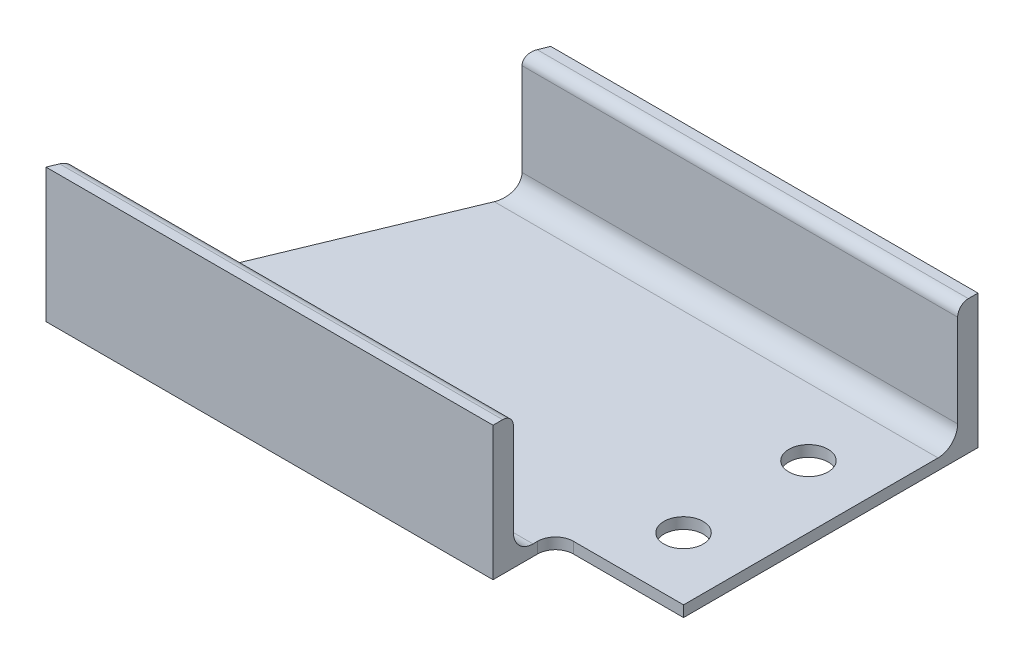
ISO-10303-21;
HEADER;
FILE_DESCRIPTION(('STEP AP214'),'2;1');
FILE_NAME('part.step','',(''),(''),'','','');
FILE_SCHEMA(('AUTOMOTIVE_DESIGN { 1 0 10303 214 1 1 1 1 }'));
ENDSEC;
DATA;
#1=APPLICATION_CONTEXT('core data for automotive mechanical design processes');
#2=APPLICATION_PROTOCOL_DEFINITION('international standard','automotive_design',2000,#1);
#3=PRODUCT_CONTEXT('',#1,'mechanical');
#4=PRODUCT('Part','Part','',(#3));
#5=PRODUCT_RELATED_PRODUCT_CATEGORY('part','',(#4));
#6=PRODUCT_DEFINITION_FORMATION('','',#4);
#7=PRODUCT_DEFINITION_CONTEXT('part definition',#1,'design');
#8=PRODUCT_DEFINITION('design','',#6,#7);
#9=PRODUCT_DEFINITION_SHAPE('','',#8);
#10=(LENGTH_UNIT() NAMED_UNIT(*) SI_UNIT(.MILLI.,.METRE.));
#11=(NAMED_UNIT(*) PLANE_ANGLE_UNIT() SI_UNIT($,.RADIAN.));
#12=(NAMED_UNIT(*) SI_UNIT($,.STERADIAN.) SOLID_ANGLE_UNIT());
#13=UNCERTAINTY_MEASURE_WITH_UNIT(LENGTH_MEASURE(1.E-05),#10,'distance_accuracy_value','');
#14=(GEOMETRIC_REPRESENTATION_CONTEXT(3) GLOBAL_UNCERTAINTY_ASSIGNED_CONTEXT((#13)) GLOBAL_UNIT_ASSIGNED_CONTEXT((#10,
#11,#12)) REPRESENTATION_CONTEXT('',''));
#15=CARTESIAN_POINT('',(0.,0.,0.));
#16=DIRECTION('',(0.,0.,1.));
#17=DIRECTION('',(1.,0.,0.));
#18=AXIS2_PLACEMENT_3D('',#15,#16,#17);
#19=CARTESIAN_POINT('',(345.,17.2000000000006,-177.6));
#20=DIRECTION('',(-1.,0.,0.));
#21=DIRECTION('',(0.,0.,1.));
#22=AXIS2_PLACEMENT_3D('',#19,#20,#21);
#23=CYLINDRICAL_SURFACE('',#22,11.);
#24=DIRECTION('',(-1.,0.,0.));
#25=VECTOR('',#24,1.);
#26=CARTESIAN_POINT('',(345.,6.20000000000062,-177.6));
#27=LINE('',#26,#25);
#28=CARTESIAN_POINT('',(322.249999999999,6.20000000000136,-177.599999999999));
#29=VERTEX_POINT('',#28);
#30=CARTESIAN_POINT('',(73.5643286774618,6.20000000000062,-177.6));
#31=VERTEX_POINT('',#30);
#32=EDGE_CURVE('E257',#29,#31,#27,.T.);
#33=ORIENTED_EDGE('',*,*,#32,.F.);
#34=CARTESIAN_POINT('',(322.249999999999,17.2000000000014,-177.599999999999));
#35=DIRECTION('',(1.,0.,0.));
#36=DIRECTION('',(0.,0.,-1.));
#37=AXIS2_PLACEMENT_3D('',#34,#35,#36);
#38=CIRCLE('',#37,11.);
#39=CARTESIAN_POINT('',(322.249999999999,17.2000000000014,-188.599999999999));
#40=VERTEX_POINT('',#39);
#41=EDGE_CURVE('E318',#40,#29,#38,.F.);
#42=ORIENTED_EDGE('',*,*,#41,.F.);
#43=DIRECTION('',(-1.,0.,0.));
#44=VECTOR('',#43,1.);
#45=CARTESIAN_POINT('',(345.,17.2000000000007,-188.6));
#46=LINE('',#45,#44);
#47=CARTESIAN_POINT('',(78.1206778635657,17.2000000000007,-188.6));
#48=VERTEX_POINT('',#47);
#49=EDGE_CURVE('E231',#40,#48,#46,.T.);
#50=ORIENTED_EDGE('',*,*,#49,.T.);
#51=CARTESIAN_POINT('',(73.5643286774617,17.2000000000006,-177.6));
#52=DIRECTION('',(-0.923879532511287,0.,-0.38268343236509));
#53=DIRECTION('',(-0.38268343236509,0.,0.923879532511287));
#54=AXIS2_PLACEMENT_3D('',#51,#52,#53);
#55=ELLIPSE('',#54,11.9063142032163,11.);
#56=EDGE_CURVE('E254',#48,#31,#55,.T.);
#57=ORIENTED_EDGE('',*,*,#56,.T.);
#58=EDGE_LOOP('',(#33,#42,#50,#57));
#59=FACE_BOUND('',#58,.T.);
#60=ADVANCED_FACE('F80',(#59),#23,.F.);
#61=CARTESIAN_POINT('',(345.,6.20000000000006,-22.3999999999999));
#62=DIRECTION('',(0.,1.,0.));
#63=DIRECTION('',(0.,0.,1.));
#64=AXIS2_PLACEMENT_3D('',#61,#62,#63);
#65=PLANE('',#64);
#66=CARTESIAN_POINT('',(287.249999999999,6.20000000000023,-69.9999999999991));
#67=DIRECTION('',(0.,1.,0.));
#68=DIRECTION('',(0.,0.,1.));
#69=AXIS2_PLACEMENT_3D('',#66,#67,#68);
#70=CIRCLE('',#69,11.);
#71=CARTESIAN_POINT('',(287.249999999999,6.20000000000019,-58.9999999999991));
#72=VERTEX_POINT('',#71);
#73=EDGE_CURVE('E224',#72,#72,#70,.F.);
#74=ORIENTED_EDGE('',*,*,#73,.T.);
#75=EDGE_LOOP('',(#74));
#76=FACE_BOUND('',#75,.T.);
#77=CARTESIAN_POINT('',(287.249999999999,6.2000000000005,-139.999999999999));
#78=DIRECTION('',(0.,1.,0.));
#79=DIRECTION('',(0.,0.,1.));
#80=AXIS2_PLACEMENT_3D('',#77,#78,#79);
#81=CIRCLE('',#80,11.);
#82=CARTESIAN_POINT('',(287.249999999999,6.20000000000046,-128.999999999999));
#83=VERTEX_POINT('',#82);
#84=EDGE_CURVE('E228',#83,#83,#81,.F.);
#85=ORIENTED_EDGE('',*,*,#84,.T.);
#86=EDGE_LOOP('',(#85));
#87=FACE_BOUND('',#86,.T.);
#88=DIRECTION('',(-1.,0.,0.));
#89=VECTOR('',#88,1.);
#90=CARTESIAN_POINT('',(-55.000000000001,6.20000000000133,-34.9999999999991));
#91=LINE('',#90,#89);
#92=CARTESIAN_POINT('',(322.249999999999,6.20000000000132,-34.9999999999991));
#93=VERTEX_POINT('',#92);
#94=CARTESIAN_POINT('',(260.499999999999,6.20000000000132,-34.9999999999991));
#95=VERTEX_POINT('',#94);
#96=EDGE_CURVE('E207',#93,#95,#91,.T.);
#97=ORIENTED_EDGE('',*,*,#96,.F.);
#98=DIRECTION('',(0.,0.,1.));
#99=VECTOR('',#98,1.);
#100=CARTESIAN_POINT('',(322.249999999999,6.20000000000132,-22.3999999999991));
#101=LINE('',#100,#99);
#102=EDGE_CURVE('E221',#29,#93,#101,.T.);
#103=ORIENTED_EDGE('',*,*,#102,.F.);
#104=ORIENTED_EDGE('',*,*,#32,.T.);
#105=DIRECTION('',(-0.38268343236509,0.,0.923879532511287));
#106=VECTOR('',#105,1.);
#107=CARTESIAN_POINT('',(58.4436761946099,6.20000000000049,-141.095515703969));
#108=LINE('',#107,#106);
#109=CARTESIAN_POINT('',(9.27838379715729,6.20000000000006,-22.3999999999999));
#110=VERTEX_POINT('',#109);
#111=EDGE_CURVE('E258',#31,#110,#108,.T.);
#112=ORIENTED_EDGE('',*,*,#111,.T.);
#113=DIRECTION('',(-1.,0.,0.));
#114=VECTOR('',#113,1.);
#115=CARTESIAN_POINT('',(345.,6.20000000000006,-22.3999999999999));
#116=LINE('',#115,#114);
#117=CARTESIAN_POINT('',(250.499999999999,6.20000000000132,-22.3999999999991));
#118=VERTEX_POINT('',#117);
#119=EDGE_CURVE('E212',#118,#110,#116,.T.);
#120=ORIENTED_EDGE('',*,*,#119,.F.);
#121=DIRECTION('',(0.,0.,1.));
#122=VECTOR('',#121,1.);
#123=CARTESIAN_POINT('',(250.499999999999,6.20000000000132,-22.3999999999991));
#124=LINE('',#123,#122);
#125=CARTESIAN_POINT('',(250.499999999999,6.20000000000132,-24.9999999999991));
#126=VERTEX_POINT('',#125);
#127=EDGE_CURVE('E192',#126,#118,#124,.T.);
#128=ORIENTED_EDGE('',*,*,#127,.F.);
#129=CARTESIAN_POINT('',(260.499999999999,6.20000000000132,-24.9999999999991));
#130=DIRECTION('',(0.,-1.,0.));
#131=DIRECTION('',(0.,0.,1.));
#132=AXIS2_PLACEMENT_3D('',#129,#130,#131);
#133=CIRCLE('',#132,9.99999999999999);
#134=EDGE_CURVE('E202',#95,#126,#133,.F.);
#135=ORIENTED_EDGE('',*,*,#134,.F.);
#136=EDGE_LOOP('',(#97,#103,#104,#112,#120,#128,#135));
#137=FACE_BOUND('',#136,.T.);
#138=ADVANCED_FACE('F210',(#76,#87,#137),#65,.T.);
#139=CARTESIAN_POINT('',(345.,17.2000000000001,-22.3999999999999));
#140=DIRECTION('',(-1.,0.,0.));
#141=DIRECTION('',(0.,0.,1.));
#142=AXIS2_PLACEMENT_3D('',#139,#140,#141);
#143=CYLINDRICAL_SURFACE('',#142,11.);
#144=CARTESIAN_POINT('',(250.499999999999,17.2000000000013,-22.3999999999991));
#145=DIRECTION('',(1.,0.,0.));
#146=DIRECTION('',(0.,1.,0.));
#147=AXIS2_PLACEMENT_3D('',#144,#145,#146);
#148=CIRCLE('',#147,11.);
#149=CARTESIAN_POINT('',(250.499999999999,17.2000000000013,-11.3999999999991));
#150=VERTEX_POINT('',#149);
#151=EDGE_CURVE('E332',#150,#118,#148,.T.);
#152=ORIENTED_EDGE('',*,*,#151,.T.);
#153=ORIENTED_EDGE('',*,*,#119,.T.);
#154=CARTESIAN_POINT('',(9.27838379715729,17.2000000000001,-22.3999999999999));
#155=DIRECTION('',(-0.923879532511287,0.,-0.38268343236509));
#156=DIRECTION('',(-0.38268343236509,0.,0.923879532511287));
#157=AXIS2_PLACEMENT_3D('',#154,#155,#156);
#158=ELLIPSE('',#157,11.9063142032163,11.);
#159=CARTESIAN_POINT('',(4.72203461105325,17.2,-11.3999999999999));
#160=VERTEX_POINT('',#159);
#161=EDGE_CURVE('E253',#160,#110,#158,.F.);
#162=ORIENTED_EDGE('',*,*,#161,.F.);
#163=DIRECTION('',(-1.,0.,0.));
#164=VECTOR('',#163,1.);
#165=CARTESIAN_POINT('',(345.,17.2,-11.3999999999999));
#166=LINE('',#165,#164);
#167=EDGE_CURVE('E266',#150,#160,#166,.T.);
#168=ORIENTED_EDGE('',*,*,#167,.F.);
#169=EDGE_LOOP('',(#152,#153,#162,#168));
#170=FACE_BOUND('',#169,.T.);
#171=ADVANCED_FACE('F363',(#170),#143,.F.);
#172=CARTESIAN_POINT('',(345.,69.,-11.3999999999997));
#173=DIRECTION('',(0.,0.,-1.));
#174=DIRECTION('',(0.,1.,0.));
#175=AXIS2_PLACEMENT_3D('',#172,#173,#174);
#176=PLANE('',#175);
#177=DIRECTION('',(-1.,0.,0.));
#178=VECTOR('',#177,1.);
#179=CARTESIAN_POINT('',(345.,69.,-11.3999999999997));
#180=LINE('',#179,#178);
#181=CARTESIAN_POINT('',(250.499999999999,69.0000000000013,-11.3999999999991));
#182=VERTEX_POINT('',#181);
#183=CARTESIAN_POINT('',(4.72203461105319,69.,-11.3999999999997));
#184=VERTEX_POINT('',#183);
#185=EDGE_CURVE('E265',#182,#184,#180,.T.);
#186=ORIENTED_EDGE('',*,*,#185,.F.);
#187=DIRECTION('',(0.,1.,0.));
#188=VECTOR('',#187,1.);
#189=CARTESIAN_POINT('',(250.499999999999,69.0000000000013,-11.3999999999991));
#190=LINE('',#189,#188);
#191=EDGE_CURVE('E330',#150,#182,#190,.T.);
#192=ORIENTED_EDGE('',*,*,#191,.F.);
#193=ORIENTED_EDGE('',*,*,#167,.T.);
#194=DIRECTION('',(0.,1.,0.));
#195=VECTOR('',#194,1.);
#196=CARTESIAN_POINT('',(4.72203461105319,68.9999999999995,-11.3999999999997));
#197=LINE('',#196,#195);
#198=EDGE_CURVE('E262',#160,#184,#197,.T.);
#199=ORIENTED_EDGE('',*,*,#198,.T.);
#200=EDGE_LOOP('',(#186,#192,#193,#199));
#201=FACE_BOUND('',#200,.T.);
#202=ADVANCED_FACE('F367',(#201),#176,.T.);
#203=CARTESIAN_POINT('',(345.,69.,-5.39999999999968));
#204=DIRECTION('',(-1.,0.,0.));
#205=DIRECTION('',(0.,0.,1.));
#206=AXIS2_PLACEMENT_3D('',#203,#204,#205);
#207=CYLINDRICAL_SURFACE('',#206,6.00000000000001);
#208=CARTESIAN_POINT('',(250.499999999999,69.0000000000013,-5.39999999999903));
#209=DIRECTION('',(1.,0.,0.));
#210=DIRECTION('',(0.,1.,0.));
#211=AXIS2_PLACEMENT_3D('',#208,#209,#210);
#212=CIRCLE('',#211,6.00000000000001);
#213=CARTESIAN_POINT('',(250.499999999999,75.0000000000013,-5.39999999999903));
#214=VERTEX_POINT('',#213);
#215=EDGE_CURVE('E327',#214,#182,#212,.F.);
#216=ORIENTED_EDGE('',*,*,#215,.T.);
#217=ORIENTED_EDGE('',*,*,#185,.T.);
#218=CARTESIAN_POINT('',(2.2367532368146,69.,-5.39999999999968));
#219=DIRECTION('',(-0.923879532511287,0.,-0.38268343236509));
#220=DIRECTION('',(-0.38268343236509,0.,0.923879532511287));
#221=AXIS2_PLACEMENT_3D('',#218,#219,#220);
#222=ELLIPSE('',#221,6.49435320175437,6.00000000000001);
#223=CARTESIAN_POINT('',(2.2367532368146,75.,-5.39999999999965));
#224=VERTEX_POINT('',#223);
#225=EDGE_CURVE('E233',#224,#184,#222,.T.);
#226=ORIENTED_EDGE('',*,*,#225,.F.);
#227=DIRECTION('',(-1.,0.,0.));
#228=VECTOR('',#227,1.);
#229=CARTESIAN_POINT('',(345.,75.,-5.39999999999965));
#230=LINE('',#229,#228);
#231=EDGE_CURVE('E270',#214,#224,#230,.T.);
#232=ORIENTED_EDGE('',*,*,#231,.F.);
#233=EDGE_LOOP('',(#216,#217,#226,#232));
#234=FACE_BOUND('',#233,.T.);
#235=ADVANCED_FACE('F370',(#234),#207,.T.);
#236=CARTESIAN_POINT('',(345.,75.,2.91433543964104E-13));
#237=DIRECTION('',(0.,1.,0.));
#238=DIRECTION('',(0.,0.,1.));
#239=AXIS2_PLACEMENT_3D('',#236,#237,#238);
#240=PLANE('',#239);
#241=DIRECTION('',(-1.,0.,0.));
#242=VECTOR('',#241,1.);
#243=CARTESIAN_POINT('',(345.,75.,2.91433543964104E-13));
#244=LINE('',#243,#242);
#245=CARTESIAN_POINT('',(250.499999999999,75.,2.91433543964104E-13));
#246=VERTEX_POINT('',#245);
#247=CARTESIAN_POINT('',(0.,75.0000000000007,0.));
#248=VERTEX_POINT('',#247);
#249=EDGE_CURVE('E104',#246,#248,#244,.T.);
#250=ORIENTED_EDGE('',*,*,#249,.F.);
#251=DIRECTION('',(0.,0.,1.));
#252=VECTOR('',#251,1.);
#253=CARTESIAN_POINT('',(250.499999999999,75.0000000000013,9.17709270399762E-13));
#254=LINE('',#253,#252);
#255=EDGE_CURVE('E97',#214,#246,#254,.T.);
#256=ORIENTED_EDGE('',*,*,#255,.F.);
#257=ORIENTED_EDGE('',*,*,#231,.T.);
#258=DIRECTION('',(-0.38268343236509,0.,0.923879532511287));
#259=VECTOR('',#258,1.);
#260=CARTESIAN_POINT('',(50.5240802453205,75.0000000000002,-121.975919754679));
#261=LINE('',#260,#259);
#262=EDGE_CURVE('E237',#224,#248,#261,.T.);
#263=ORIENTED_EDGE('',*,*,#262,.T.);
#264=EDGE_LOOP('',(#250,#256,#257,#263));
#265=FACE_BOUND('',#264,.T.);
#266=ADVANCED_FACE('F291',(#265),#240,.T.);
#267=CARTESIAN_POINT('',(345.,0.,0.));
#268=DIRECTION('',(0.,1.,0.));
#269=DIRECTION('',(0.,0.,1.));
#270=AXIS2_PLACEMENT_3D('',#267,#268,#269);
#271=PLANE('',#270);
#272=CARTESIAN_POINT('',(287.249999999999,4.85722573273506E-13,-139.999999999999));
#273=DIRECTION('',(0.,1.,0.));
#274=DIRECTION('',(0.,0.,1.));
#275=AXIS2_PLACEMENT_3D('',#272,#273,#274);
#276=CIRCLE('',#275,11.);
#277=CARTESIAN_POINT('',(287.249999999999,4.47697917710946E-13,-128.999999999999));
#278=VERTEX_POINT('',#277);
#279=EDGE_CURVE('E227',#278,#278,#276,.F.);
#280=ORIENTED_EDGE('',*,*,#279,.F.);
#281=EDGE_LOOP('',(#280));
#282=FACE_BOUND('',#281,.T.);
#283=CARTESIAN_POINT('',(287.249999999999,2.35922392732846E-13,-69.9999999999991));
#284=DIRECTION('',(0.,1.,0.));
#285=DIRECTION('',(0.,0.,1.));
#286=AXIS2_PLACEMENT_3D('',#283,#284,#285);
#287=CIRCLE('',#286,11.);
#288=CARTESIAN_POINT('',(287.249999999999,1.97897737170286E-13,-58.9999999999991));
#289=VERTEX_POINT('',#288);
#290=EDGE_CURVE('E84',#289,#289,#287,.F.);
#291=ORIENTED_EDGE('',*,*,#290,.F.);
#292=EDGE_LOOP('',(#291));
#293=FACE_BOUND('',#292,.T.);
#294=DIRECTION('',(0.,0.,1.));
#295=VECTOR('',#294,1.);
#296=CARTESIAN_POINT('',(322.249999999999,1.33226762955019E-12,8.39467826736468E-13));
#297=LINE('',#296,#295);
#298=CARTESIAN_POINT('',(322.249999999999,1.34982167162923E-12,-199.999999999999));
#299=VERTEX_POINT('',#298);
#300=CARTESIAN_POINT('',(322.249999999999,1.3365538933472E-12,-34.9999999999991));
#301=VERTEX_POINT('',#300);
#302=EDGE_CURVE('E213',#299,#301,#297,.T.);
#303=ORIENTED_EDGE('',*,*,#302,.T.);
#304=DIRECTION('',(-1.,0.,0.));
#305=VECTOR('',#304,1.);
#306=CARTESIAN_POINT('',(-55.0000000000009,1.33533958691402E-12,-34.9999999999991));
#307=LINE('',#306,#305);
#308=CARTESIAN_POINT('',(260.499999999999,1.3365538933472E-12,-34.9999999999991));
#309=VERTEX_POINT('',#308);
#310=EDGE_CURVE('E299',#301,#309,#307,.T.);
#311=ORIENTED_EDGE('',*,*,#310,.T.);
#312=CARTESIAN_POINT('',(260.499999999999,1.33532924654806E-12,-24.9999999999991));
#313=DIRECTION('',(0.,-1.,0.));
#314=DIRECTION('',(0.,0.,1.));
#315=AXIS2_PLACEMENT_3D('',#312,#313,#314);
#316=CIRCLE('',#315,9.99999999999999);
#317=CARTESIAN_POINT('',(250.499999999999,1.33532924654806E-12,-24.9999999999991));
#318=VERTEX_POINT('',#317);
#319=EDGE_CURVE('E321',#309,#318,#316,.F.);
#320=ORIENTED_EDGE('',*,*,#319,.T.);
#321=DIRECTION('',(0.,0.,1.));
#322=VECTOR('',#321,1.);
#323=CARTESIAN_POINT('',(250.499999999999,1.33226762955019E-12,8.76605507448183E-13));
#324=LINE('',#323,#322);
#325=CARTESIAN_POINT('',(250.499999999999,1.33226762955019E-12,8.76605507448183E-13));
#326=VERTEX_POINT('',#325);
#327=EDGE_CURVE('E195',#318,#326,#324,.T.);
#328=ORIENTED_EDGE('',*,*,#327,.T.);
#329=DIRECTION('',(-1.,0.,0.));
#330=VECTOR('',#329,1.);
#331=CARTESIAN_POINT('',(345.,0.,0.));
#332=LINE('',#331,#330);
#333=CARTESIAN_POINT('',(0.,0.,0.));
#334=VERTEX_POINT('',#333);
#335=EDGE_CURVE('E235',#326,#334,#332,.T.);
#336=ORIENTED_EDGE('',*,*,#335,.T.);
#337=DIRECTION('',(-0.38268343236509,0.,0.923879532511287));
#338=VECTOR('',#337,1.);
#339=CARTESIAN_POINT('',(50.5240802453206,4.18175310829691E-13,-121.975919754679));
#340=LINE('',#339,#338);
#341=CARTESIAN_POINT('',(82.842712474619,6.90419943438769E-13,-200.));
#342=VERTEX_POINT('',#341);
#343=EDGE_CURVE('E89',#342,#334,#340,.T.);
#344=ORIENTED_EDGE('',*,*,#343,.F.);
#345=DIRECTION('',(-1.,0.,0.));
#346=VECTOR('',#345,1.);
#347=CARTESIAN_POINT('',(345.,6.90419943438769E-13,-200.));
#348=LINE('',#347,#346);
#349=EDGE_CURVE('E236',#299,#342,#348,.T.);
#350=ORIENTED_EDGE('',*,*,#349,.F.);
#351=EDGE_LOOP('',(#303,#311,#320,#328,#336,#344,#350));
#352=FACE_BOUND('',#351,.T.);
#353=ADVANCED_FACE('F287',(#282,#293,#352),#271,.F.);
#354=CARTESIAN_POINT('',(345.,6.90419943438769E-13,-200.));
#355=DIRECTION('',(0.,0.,1.));
#356=DIRECTION('',(0.,-1.,0.));
#357=AXIS2_PLACEMENT_3D('',#354,#355,#356);
#358=PLANE('',#357);
#359=DIRECTION('',(0.,-1.,0.));
#360=VECTOR('',#359,1.);
#361=CARTESIAN_POINT('',(322.249999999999,1.34982167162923E-12,-199.999999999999));
#362=LINE('',#361,#360);
#363=CARTESIAN_POINT('',(322.249999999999,75.0000000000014,-199.999999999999));
#364=VERTEX_POINT('',#363);
#365=EDGE_CURVE('E216',#364,#299,#362,.T.);
#366=ORIENTED_EDGE('',*,*,#365,.T.);
#367=ORIENTED_EDGE('',*,*,#349,.T.);
#368=DIRECTION('',(0.,-1.,0.));
#369=VECTOR('',#368,1.);
#370=CARTESIAN_POINT('',(82.842712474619,3.07020740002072E-13,-200.));
#371=LINE('',#370,#369);
#372=CARTESIAN_POINT('',(82.8427124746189,75.0000000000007,-200.));
#373=VERTEX_POINT('',#372);
#374=EDGE_CURVE('E241',#373,#342,#371,.T.);
#375=ORIENTED_EDGE('',*,*,#374,.F.);
#376=DIRECTION('',(-1.,0.,0.));
#377=VECTOR('',#376,1.);
#378=CARTESIAN_POINT('',(345.,75.0000000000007,-200.));
#379=LINE('',#378,#377);
#380=EDGE_CURVE('E277',#364,#373,#379,.T.);
#381=ORIENTED_EDGE('',*,*,#380,.F.);
#382=EDGE_LOOP('',(#366,#367,#375,#381));
#383=FACE_BOUND('',#382,.T.);
#384=ADVANCED_FACE('F290',(#383),#358,.F.);
#385=CARTESIAN_POINT('',(345.,75.0000000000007,-200.));
#386=DIRECTION('',(0.,-1.,0.));
#387=DIRECTION('',(0.,0.,-1.));
#388=AXIS2_PLACEMENT_3D('',#385,#386,#387);
#389=PLANE('',#388);
#390=DIRECTION('',(0.,0.,-1.));
#391=VECTOR('',#390,1.);
#392=CARTESIAN_POINT('',(322.249999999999,75.0000000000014,-199.999999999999));
#393=LINE('',#392,#391);
#394=CARTESIAN_POINT('',(322.249999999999,75.0000000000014,-194.599999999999));
#395=VERTEX_POINT('',#394);
#396=EDGE_CURVE('E309',#395,#364,#393,.T.);
#397=ORIENTED_EDGE('',*,*,#396,.T.);
#398=ORIENTED_EDGE('',*,*,#380,.T.);
#399=DIRECTION('',(0.38268343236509,0.,-0.923879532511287));
#400=VECTOR('',#399,1.);
#401=CARTESIAN_POINT('',(121.234758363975,75.000000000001,-292.686597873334));
#402=LINE('',#401,#400);
#403=CARTESIAN_POINT('',(80.6059592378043,75.0000000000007,-194.6));
#404=VERTEX_POINT('',#403);
#405=EDGE_CURVE('E244',#404,#373,#402,.T.);
#406=ORIENTED_EDGE('',*,*,#405,.F.);
#407=DIRECTION('',(-1.,0.,0.));
#408=VECTOR('',#407,1.);
#409=CARTESIAN_POINT('',(345.,75.0000000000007,-194.6));
#410=LINE('',#409,#408);
#411=EDGE_CURVE('E279',#395,#404,#410,.T.);
#412=ORIENTED_EDGE('',*,*,#411,.F.);
#413=EDGE_LOOP('',(#397,#398,#406,#412));
#414=FACE_BOUND('',#413,.T.);
#415=ADVANCED_FACE('F345',(#414),#389,.F.);
#416=CARTESIAN_POINT('',(345.,69.0000000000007,-194.6));
#417=DIRECTION('',(-1.,0.,0.));
#418=DIRECTION('',(0.,0.,1.));
#419=AXIS2_PLACEMENT_3D('',#416,#417,#418);
#420=CYLINDRICAL_SURFACE('',#419,6.00000000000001);
#421=CARTESIAN_POINT('',(322.249999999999,69.0000000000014,-194.599999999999));
#422=DIRECTION('',(1.,0.,0.));
#423=DIRECTION('',(0.,0.,-1.));
#424=AXIS2_PLACEMENT_3D('',#421,#422,#423);
#425=CIRCLE('',#424,6.00000000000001);
#426=CARTESIAN_POINT('',(322.249999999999,69.0000000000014,-188.599999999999));
#427=VERTEX_POINT('',#426);
#428=EDGE_CURVE('E310',#427,#395,#425,.F.);
#429=ORIENTED_EDGE('',*,*,#428,.T.);
#430=ORIENTED_EDGE('',*,*,#411,.T.);
#431=CARTESIAN_POINT('',(80.6059592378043,69.0000000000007,-194.6));
#432=DIRECTION('',(-0.923879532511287,0.,-0.38268343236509));
#433=DIRECTION('',(-0.38268343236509,0.,0.923879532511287));
#434=AXIS2_PLACEMENT_3D('',#431,#432,#433);
#435=ELLIPSE('',#434,6.49435320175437,6.00000000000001);
#436=CARTESIAN_POINT('',(78.1206778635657,69.0000000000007,-188.6));
#437=VERTEX_POINT('',#436);
#438=EDGE_CURVE('E247',#437,#404,#435,.T.);
#439=ORIENTED_EDGE('',*,*,#438,.F.);
#440=DIRECTION('',(-1.,0.,0.));
#441=VECTOR('',#440,1.);
#442=CARTESIAN_POINT('',(345.,69.0000000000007,-188.6));
#443=LINE('',#442,#441);
#444=EDGE_CURVE('E234',#427,#437,#443,.T.);
#445=ORIENTED_EDGE('',*,*,#444,.F.);
#446=EDGE_LOOP('',(#429,#430,#439,#445));
#447=FACE_BOUND('',#446,.T.);
#448=ADVANCED_FACE('F348',(#447),#420,.T.);
#449=CARTESIAN_POINT('',(345.,69.0000000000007,-188.6));
#450=DIRECTION('',(0.,0.,-1.));
#451=DIRECTION('',(0.,1.,0.));
#452=AXIS2_PLACEMENT_3D('',#449,#450,#451);
#453=PLANE('',#452);
#454=DIRECTION('',(0.,1.,0.));
#455=VECTOR('',#454,1.);
#456=CARTESIAN_POINT('',(322.249999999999,69.0000000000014,-188.599999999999));
#457=LINE('',#456,#455);
#458=EDGE_CURVE('E315',#40,#427,#457,.T.);
#459=ORIENTED_EDGE('',*,*,#458,.T.);
#460=ORIENTED_EDGE('',*,*,#444,.T.);
#461=DIRECTION('',(0.,1.,0.));
#462=VECTOR('',#461,1.);
#463=CARTESIAN_POINT('',(78.1206778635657,69.0000000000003,-188.6));
#464=LINE('',#463,#462);
#465=EDGE_CURVE('E250',#48,#437,#464,.T.);
#466=ORIENTED_EDGE('',*,*,#465,.F.);
#467=ORIENTED_EDGE('',*,*,#49,.F.);
#468=EDGE_LOOP('',(#459,#460,#466,#467));
#469=FACE_BOUND('',#468,.T.);
#470=ADVANCED_FACE('F351',(#469),#453,.F.);
#471=CARTESIAN_POINT('',(345.,0.,0.));
#472=DIRECTION('',(0.,0.,1.));
#473=DIRECTION('',(0.,-1.,0.));
#474=AXIS2_PLACEMENT_3D('',#471,#472,#473);
#475=PLANE('',#474);
#476=ORIENTED_EDGE('',*,*,#335,.F.);
#477=DIRECTION('',(0.,-1.,0.));
#478=VECTOR('',#477,1.);
#479=CARTESIAN_POINT('',(250.499999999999,1.33226762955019E-12,8.76605507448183E-13));
#480=LINE('',#479,#478);
#481=EDGE_CURVE('E324',#246,#326,#480,.T.);
#482=ORIENTED_EDGE('',*,*,#481,.F.);
#483=ORIENTED_EDGE('',*,*,#249,.T.);
#484=DIRECTION('',(0.,1.,0.));
#485=VECTOR('',#484,1.);
#486=CARTESIAN_POINT('',(0.,17.2000000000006,0.));
#487=LINE('',#486,#485);
#488=EDGE_CURVE('E13',#334,#248,#487,.T.);
#489=ORIENTED_EDGE('',*,*,#488,.F.);
#490=EDGE_LOOP('',(#476,#482,#483,#489));
#491=FACE_BOUND('',#490,.T.);
#492=ADVANCED_FACE('F338',(#491),#475,.T.);
#493=CARTESIAN_POINT('',(0.,0.,0.));
#494=DIRECTION('',(-0.923879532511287,0.,-0.38268343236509));
#495=DIRECTION('',(-0.38268343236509,0.,0.923879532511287));
#496=AXIS2_PLACEMENT_3D('',#493,#494,#495);
#497=PLANE('',#496);
#498=ORIENTED_EDGE('',*,*,#262,.F.);
#499=ORIENTED_EDGE('',*,*,#225,.T.);
#500=ORIENTED_EDGE('',*,*,#198,.F.);
#501=ORIENTED_EDGE('',*,*,#161,.T.);
#502=ORIENTED_EDGE('',*,*,#111,.F.);
#503=ORIENTED_EDGE('',*,*,#56,.F.);
#504=ORIENTED_EDGE('',*,*,#465,.T.);
#505=ORIENTED_EDGE('',*,*,#438,.T.);
#506=ORIENTED_EDGE('',*,*,#405,.T.);
#507=ORIENTED_EDGE('',*,*,#374,.T.);
#508=ORIENTED_EDGE('',*,*,#343,.T.);
#509=ORIENTED_EDGE('',*,*,#488,.T.);
#510=EDGE_LOOP('',(#498,#499,#500,#501,#502,#503,#504,#505,#506,#507,#508,#509));
#511=FACE_BOUND('',#510,.T.);
#512=ADVANCED_FACE('F82',(#511),#497,.T.);
#513=CARTESIAN_POINT('',(287.249999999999,-81.7999999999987,-139.999999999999));
#514=DIRECTION('',(0.,1.,0.));
#515=DIRECTION('',(-1.,0.,0.));
#516=AXIS2_PLACEMENT_3D('',#513,#514,#515);
#517=CYLINDRICAL_SURFACE('',#516,11.);
#518=ORIENTED_EDGE('',*,*,#84,.F.);
#519=EDGE_LOOP('',(#518));
#520=FACE_BOUND('',#519,.T.);
#521=ORIENTED_EDGE('',*,*,#279,.T.);
#522=EDGE_LOOP('',(#521));
#523=FACE_BOUND('',#522,.T.);
#524=ADVANCED_FACE('F285',(#520,#523),#517,.F.);
#525=CARTESIAN_POINT('',(287.249999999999,-81.7999999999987,-69.9999999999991));
#526=DIRECTION('',(0.,1.,0.));
#527=DIRECTION('',(-1.,0.,0.));
#528=AXIS2_PLACEMENT_3D('',#525,#526,#527);
#529=CYLINDRICAL_SURFACE('',#528,11.);
#530=ORIENTED_EDGE('',*,*,#73,.F.);
#531=EDGE_LOOP('',(#530));
#532=FACE_BOUND('',#531,.T.);
#533=ORIENTED_EDGE('',*,*,#290,.T.);
#534=EDGE_LOOP('',(#533));
#535=FACE_BOUND('',#534,.T.);
#536=ADVANCED_FACE('F465',(#532,#535),#529,.F.);
#537=CARTESIAN_POINT('',(260.499999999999,150.000000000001,-34.9999999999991));
#538=DIRECTION('',(0.,0.,1.));
#539=DIRECTION('',(1.,0.,0.));
#540=AXIS2_PLACEMENT_3D('',#537,#538,#539);
#541=PLANE('',#540);
#542=ORIENTED_EDGE('',*,*,#310,.F.);
#543=DIRECTION('',(0.,-1.,0.));
#544=VECTOR('',#543,1.);
#545=CARTESIAN_POINT('',(322.249999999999,150.000000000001,-34.9999999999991));
#546=LINE('',#545,#544);
#547=EDGE_CURVE('E305',#93,#301,#546,.T.);
#548=ORIENTED_EDGE('',*,*,#547,.F.);
#549=ORIENTED_EDGE('',*,*,#96,.T.);
#550=DIRECTION('',(0.,-1.,0.));
#551=VECTOR('',#550,1.);
#552=CARTESIAN_POINT('',(260.499999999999,150.000000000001,-34.9999999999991));
#553=LINE('',#552,#551);
#554=EDGE_CURVE('E199',#95,#309,#553,.T.);
#555=ORIENTED_EDGE('',*,*,#554,.T.);
#556=EDGE_LOOP('',(#542,#548,#549,#555));
#557=FACE_BOUND('',#556,.T.);
#558=ADVANCED_FACE('F336',(#557),#541,.T.);
#559=CARTESIAN_POINT('',(260.499999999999,150.000000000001,-24.9999999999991));
#560=DIRECTION('',(0.,-1.,0.));
#561=DIRECTION('',(1.,0.,0.));
#562=AXIS2_PLACEMENT_3D('',#559,#560,#561);
#563=CYLINDRICAL_SURFACE('',#562,9.99999999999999);
#564=ORIENTED_EDGE('',*,*,#319,.F.);
#565=ORIENTED_EDGE('',*,*,#554,.F.);
#566=ORIENTED_EDGE('',*,*,#134,.T.);
#567=DIRECTION('',(0.,-1.,0.));
#568=VECTOR('',#567,1.);
#569=CARTESIAN_POINT('',(250.499999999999,150.000000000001,-24.9999999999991));
#570=LINE('',#569,#568);
#571=EDGE_CURVE('E188',#126,#318,#570,.T.);
#572=ORIENTED_EDGE('',*,*,#571,.T.);
#573=EDGE_LOOP('',(#564,#565,#566,#572));
#574=FACE_BOUND('',#573,.T.);
#575=ADVANCED_FACE('F203',(#574),#563,.F.);
#576=CARTESIAN_POINT('',(322.249999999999,150.000000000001,-34.9999999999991));
#577=DIRECTION('',(1.,0.,0.));
#578=DIRECTION('',(0.,0.,-1.));
#579=AXIS2_PLACEMENT_3D('',#576,#577,#578);
#580=PLANE('',#579);
#581=ORIENTED_EDGE('',*,*,#302,.F.);
#582=ORIENTED_EDGE('',*,*,#365,.F.);
#583=ORIENTED_EDGE('',*,*,#396,.F.);
#584=ORIENTED_EDGE('',*,*,#428,.F.);
#585=ORIENTED_EDGE('',*,*,#458,.F.);
#586=ORIENTED_EDGE('',*,*,#41,.T.);
#587=ORIENTED_EDGE('',*,*,#102,.T.);
#588=ORIENTED_EDGE('',*,*,#547,.T.);
#589=EDGE_LOOP('',(#581,#582,#583,#584,#585,#586,#587,#588));
#590=FACE_BOUND('',#589,.T.);
#591=ADVANCED_FACE('F303',(#590),#580,.T.);
#592=CARTESIAN_POINT('',(250.499999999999,150.000000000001,200.000000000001));
#593=DIRECTION('',(1.,0.,0.));
#594=DIRECTION('',(0.,1.,0.));
#595=AXIS2_PLACEMENT_3D('',#592,#593,#594);
#596=PLANE('',#595);
#597=ORIENTED_EDGE('',*,*,#327,.F.);
#598=ORIENTED_EDGE('',*,*,#571,.F.);
#599=ORIENTED_EDGE('',*,*,#127,.T.);
#600=ORIENTED_EDGE('',*,*,#151,.F.);
#601=ORIENTED_EDGE('',*,*,#191,.T.);
#602=ORIENTED_EDGE('',*,*,#215,.F.);
#603=ORIENTED_EDGE('',*,*,#255,.T.);
#604=ORIENTED_EDGE('',*,*,#481,.T.);
#605=EDGE_LOOP('',(#597,#598,#599,#600,#601,#602,#603,#604));
#606=FACE_BOUND('',#605,.T.);
#607=ADVANCED_FACE('F190',(#606),#596,.T.);
#608=CLOSED_SHELL('',(#60,#138,#171,#202,#235,#266,#353,#384,#415,#448,#470,#492,#512,#524,#536,
#558,#575,#591,#607));
#609=MANIFOLD_SOLID_BREP('B2',#608);
#610=ADVANCED_BREP_SHAPE_REPRESENTATION('',(#18,#609),#14);
#611=SHAPE_DEFINITION_REPRESENTATION(#9,#610);
ENDSEC;
END-ISO-10303-21;
